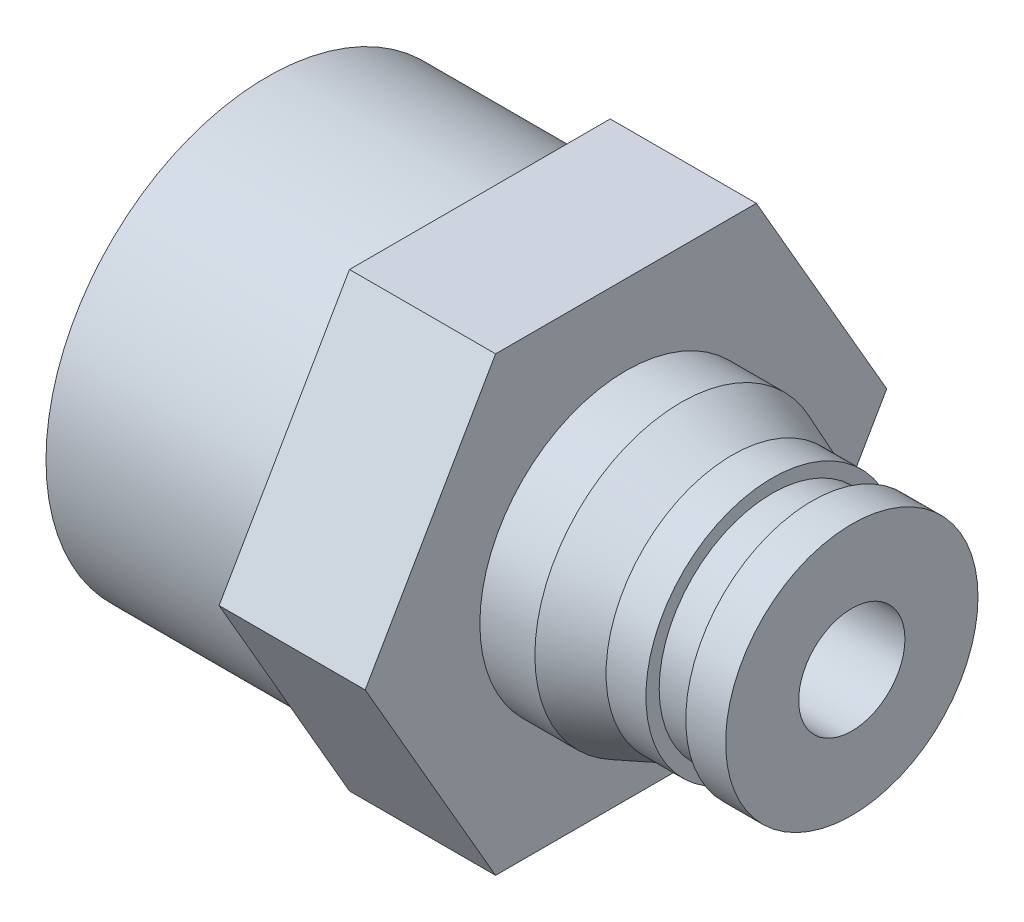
ISO-10303-21;
HEADER;
FILE_DESCRIPTION(('STEP AP214'),'2;1');
FILE_NAME('part.step','',(''),(''),'','','');
FILE_SCHEMA(('AUTOMOTIVE_DESIGN { 1 0 10303 214 1 1 1 1 }'));
ENDSEC;
DATA;
#1=APPLICATION_CONTEXT('core data for automotive mechanical design processes');
#2=APPLICATION_PROTOCOL_DEFINITION('international standard','automotive_design',2000,#1);
#3=PRODUCT_CONTEXT('',#1,'mechanical');
#4=PRODUCT('Part','Part','',(#3));
#5=PRODUCT_RELATED_PRODUCT_CATEGORY('part','',(#4));
#6=PRODUCT_DEFINITION_FORMATION('','',#4);
#7=PRODUCT_DEFINITION_CONTEXT('part definition',#1,'design');
#8=PRODUCT_DEFINITION('design','',#6,#7);
#9=PRODUCT_DEFINITION_SHAPE('','',#8);
#10=(LENGTH_UNIT() NAMED_UNIT(*) SI_UNIT(.MILLI.,.METRE.));
#11=(NAMED_UNIT(*) PLANE_ANGLE_UNIT() SI_UNIT($,.RADIAN.));
#12=(NAMED_UNIT(*) SI_UNIT($,.STERADIAN.) SOLID_ANGLE_UNIT());
#13=UNCERTAINTY_MEASURE_WITH_UNIT(LENGTH_MEASURE(1.E-05),#10,'distance_accuracy_value','');
#14=(GEOMETRIC_REPRESENTATION_CONTEXT(3) GLOBAL_UNCERTAINTY_ASSIGNED_CONTEXT((#13)) GLOBAL_UNIT_ASSIGNED_CONTEXT((#10,
#11,#12)) REPRESENTATION_CONTEXT('',''));
#15=CARTESIAN_POINT('',(0.,0.,0.));
#16=DIRECTION('',(0.,0.,1.));
#17=DIRECTION('',(1.,0.,0.));
#18=AXIS2_PLACEMENT_3D('',#15,#16,#17);
#19=CARTESIAN_POINT('',(8.,8.33,0.));
#20=DIRECTION('',(-1.,0.,0.));
#21=DIRECTION('',(0.,0.,1.));
#22=AXIS2_PLACEMENT_3D('',#19,#20,#21);
#23=PLANE('',#22);
#24=CARTESIAN_POINT('',(8.,0.,0.));
#25=DIRECTION('',(1.,0.,0.));
#26=DIRECTION('',(0.,0.,-1.));
#27=AXIS2_PLACEMENT_3D('',#24,#25,#26);
#28=CIRCLE('',#27,8.33);
#29=CARTESIAN_POINT('',(8.,0.,-8.33));
#30=VERTEX_POINT('',#29);
#31=EDGE_CURVE('E215',#30,#30,#28,.T.);
#32=ORIENTED_EDGE('',*,*,#31,.T.);
#33=EDGE_LOOP('',(#32));
#34=FACE_BOUND('',#33,.T.);
#35=DIRECTION('',(0.,-0.866025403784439,0.5));
#36=VECTOR('',#35,1.);
#37=CARTESIAN_POINT('',(8.,0.,-9.81495457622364));
#38=LINE('',#37,#36);
#39=CARTESIAN_POINT('',(8.,0.,-9.81495457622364));
#40=VERTEX_POINT('',#39);
#41=CARTESIAN_POINT('',(8.,-8.5,-4.90747728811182));
#42=VERTEX_POINT('',#41);
#43=EDGE_CURVE('E121',#40,#42,#38,.T.);
#44=ORIENTED_EDGE('',*,*,#43,.T.);
#45=DIRECTION('',(0.,0.,1.));
#46=VECTOR('',#45,1.);
#47=CARTESIAN_POINT('',(8.,-8.5,-4.90747728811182));
#48=LINE('',#47,#46);
#49=CARTESIAN_POINT('',(8.,-8.5,4.90747728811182));
#50=VERTEX_POINT('',#49);
#51=EDGE_CURVE('E106',#42,#50,#48,.T.);
#52=ORIENTED_EDGE('',*,*,#51,.T.);
#53=DIRECTION('',(0.,0.866025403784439,0.5));
#54=VECTOR('',#53,1.);
#55=CARTESIAN_POINT('',(8.,-8.5,4.90747728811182));
#56=LINE('',#55,#54);
#57=CARTESIAN_POINT('',(8.,0.,9.81495457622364));
#58=VERTEX_POINT('',#57);
#59=EDGE_CURVE('E115',#50,#58,#56,.T.);
#60=ORIENTED_EDGE('',*,*,#59,.T.);
#61=DIRECTION('',(0.,0.866025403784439,-0.5));
#62=VECTOR('',#61,1.);
#63=CARTESIAN_POINT('',(8.,0.,9.81495457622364));
#64=LINE('',#63,#62);
#65=CARTESIAN_POINT('',(8.,8.5,4.90747728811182));
#66=VERTEX_POINT('',#65);
#67=EDGE_CURVE('E30',#58,#66,#64,.T.);
#68=ORIENTED_EDGE('',*,*,#67,.T.);
#69=DIRECTION('',(0.,0.,-1.));
#70=VECTOR('',#69,1.);
#71=CARTESIAN_POINT('',(8.,8.5,4.90747728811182));
#72=LINE('',#71,#70);
#73=CARTESIAN_POINT('',(8.,8.5,-4.90747728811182));
#74=VERTEX_POINT('',#73);
#75=EDGE_CURVE('E125',#66,#74,#72,.T.);
#76=ORIENTED_EDGE('',*,*,#75,.T.);
#77=DIRECTION('',(0.,-0.866025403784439,-0.5));
#78=VECTOR('',#77,1.);
#79=CARTESIAN_POINT('',(8.,8.5,-4.90747728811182));
#80=LINE('',#79,#78);
#81=EDGE_CURVE('E128',#74,#40,#80,.T.);
#82=ORIENTED_EDGE('',*,*,#81,.T.);
#83=EDGE_LOOP('',(#44,#52,#60,#68,#76,#82));
#84=FACE_BOUND('',#83,.T.);
#85=ADVANCED_FACE('F15',(#34,#84),#23,.T.);
#86=CARTESIAN_POINT('',(13.5,10.5,0.));
#87=DIRECTION('',(1.,0.,0.));
#88=DIRECTION('',(0.,0.,-1.));
#89=AXIS2_PLACEMENT_3D('',#86,#87,#88);
#90=PLANE('',#89);
#91=CARTESIAN_POINT('',(13.5,0.,0.));
#92=DIRECTION('',(1.,0.,0.));
#93=DIRECTION('',(0.,0.,-1.));
#94=AXIS2_PLACEMENT_3D('',#91,#92,#93);
#95=CIRCLE('',#94,5.49960260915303);
#96=CARTESIAN_POINT('',(13.5,0.,-5.49960260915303));
#97=VERTEX_POINT('',#96);
#98=EDGE_CURVE('E212',#97,#97,#95,.T.);
#99=ORIENTED_EDGE('',*,*,#98,.F.);
#100=EDGE_LOOP('',(#99));
#101=FACE_BOUND('',#100,.T.);
#102=DIRECTION('',(0.,0.866025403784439,0.5));
#103=VECTOR('',#102,1.);
#104=CARTESIAN_POINT('',(13.5,-8.5,4.90747728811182));
#105=LINE('',#104,#103);
#106=CARTESIAN_POINT('',(13.5,-8.5,4.90747728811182));
#107=VERTEX_POINT('',#106);
#108=CARTESIAN_POINT('',(13.5,0.,9.81495457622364));
#109=VERTEX_POINT('',#108);
#110=EDGE_CURVE('E132',#107,#109,#105,.T.);
#111=ORIENTED_EDGE('',*,*,#110,.F.);
#112=DIRECTION('',(0.,0.,1.));
#113=VECTOR('',#112,1.);
#114=CARTESIAN_POINT('',(13.5,-8.5,-4.90747728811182));
#115=LINE('',#114,#113);
#116=CARTESIAN_POINT('',(13.5,-8.5,-4.90747728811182));
#117=VERTEX_POINT('',#116);
#118=EDGE_CURVE('E38',#117,#107,#115,.T.);
#119=ORIENTED_EDGE('',*,*,#118,.F.);
#120=DIRECTION('',(0.,-0.866025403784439,0.5));
#121=VECTOR('',#120,1.);
#122=CARTESIAN_POINT('',(13.5,0.,-9.81495457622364));
#123=LINE('',#122,#121);
#124=CARTESIAN_POINT('',(13.5,0.,-9.81495457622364));
#125=VERTEX_POINT('',#124);
#126=EDGE_CURVE('E112',#125,#117,#123,.T.);
#127=ORIENTED_EDGE('',*,*,#126,.F.);
#128=DIRECTION('',(0.,-0.866025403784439,-0.5));
#129=VECTOR('',#128,1.);
#130=CARTESIAN_POINT('',(13.5,8.5,-4.90747728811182));
#131=LINE('',#130,#129);
#132=CARTESIAN_POINT('',(13.5,8.5,-4.90747728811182));
#133=VERTEX_POINT('',#132);
#134=EDGE_CURVE('E140',#133,#125,#131,.T.);
#135=ORIENTED_EDGE('',*,*,#134,.F.);
#136=DIRECTION('',(0.,0.,-1.));
#137=VECTOR('',#136,1.);
#138=CARTESIAN_POINT('',(13.5,8.5,4.90747728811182));
#139=LINE('',#138,#137);
#140=CARTESIAN_POINT('',(13.5,8.5,4.90747728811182));
#141=VERTEX_POINT('',#140);
#142=EDGE_CURVE('E137',#141,#133,#139,.T.);
#143=ORIENTED_EDGE('',*,*,#142,.F.);
#144=DIRECTION('',(0.,0.866025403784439,-0.5));
#145=VECTOR('',#144,1.);
#146=CARTESIAN_POINT('',(13.5,0.,9.81495457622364));
#147=LINE('',#146,#145);
#148=EDGE_CURVE('E134',#109,#141,#147,.T.);
#149=ORIENTED_EDGE('',*,*,#148,.F.);
#150=EDGE_LOOP('',(#111,#119,#127,#135,#143,#149));
#151=FACE_BOUND('',#150,.T.);
#152=ADVANCED_FACE('F269',(#101,#151),#90,.T.);
#153=CARTESIAN_POINT('',(0.,0.,0.));
#154=DIRECTION('',(-1.,0.,0.));
#155=DIRECTION('',(0.,0.,1.));
#156=AXIS2_PLACEMENT_3D('',#153,#154,#155);
#157=PLANE('',#156);
#158=CARTESIAN_POINT('',(0.,0.,0.));
#159=DIRECTION('',(1.,0.,0.));
#160=DIRECTION('',(0.,0.,-1.));
#161=AXIS2_PLACEMENT_3D('',#158,#159,#160);
#162=CIRCLE('',#161,8.33);
#163=CARTESIAN_POINT('',(0.,0.,-8.33));
#164=VERTEX_POINT('',#163);
#165=EDGE_CURVE('E218',#164,#164,#162,.T.);
#166=ORIENTED_EDGE('',*,*,#165,.F.);
#167=EDGE_LOOP('',(#166));
#168=FACE_BOUND('',#167,.T.);
#169=DIRECTION('',(0.,-0.866025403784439,-0.5));
#170=VECTOR('',#169,1.);
#171=CARTESIAN_POINT('',(0.,0.,1.73205080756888));
#172=LINE('',#171,#170);
#173=CARTESIAN_POINT('',(0.,0.,1.73205080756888));
#174=VERTEX_POINT('',#173);
#175=CARTESIAN_POINT('',(0.,-1.5,0.866025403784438));
#176=VERTEX_POINT('',#175);
#177=EDGE_CURVE('E169',#174,#176,#172,.T.);
#178=ORIENTED_EDGE('',*,*,#177,.T.);
#179=DIRECTION('',(0.,0.,-1.));
#180=VECTOR('',#179,1.);
#181=CARTESIAN_POINT('',(0.,-1.5,0.866025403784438));
#182=LINE('',#181,#180);
#183=CARTESIAN_POINT('',(0.,-1.5,-0.866025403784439));
#184=VERTEX_POINT('',#183);
#185=EDGE_CURVE('E147',#176,#184,#182,.T.);
#186=ORIENTED_EDGE('',*,*,#185,.T.);
#187=DIRECTION('',(0.,0.866025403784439,-0.5));
#188=VECTOR('',#187,1.);
#189=CARTESIAN_POINT('',(0.,-1.5,-0.866025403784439));
#190=LINE('',#189,#188);
#191=CARTESIAN_POINT('',(0.,0.,-1.73205080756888));
#192=VERTEX_POINT('',#191);
#193=EDGE_CURVE('E157',#184,#192,#190,.T.);
#194=ORIENTED_EDGE('',*,*,#193,.T.);
#195=DIRECTION('',(0.,0.866025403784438,0.5));
#196=VECTOR('',#195,1.);
#197=CARTESIAN_POINT('',(0.,0.,-1.73205080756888));
#198=LINE('',#197,#196);
#199=CARTESIAN_POINT('',(0.,1.5,-0.866025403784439));
#200=VERTEX_POINT('',#199);
#201=EDGE_CURVE('E160',#192,#200,#198,.T.);
#202=ORIENTED_EDGE('',*,*,#201,.T.);
#203=DIRECTION('',(0.,0.,1.));
#204=VECTOR('',#203,1.);
#205=CARTESIAN_POINT('',(0.,1.5,-0.866025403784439));
#206=LINE('',#205,#204);
#207=CARTESIAN_POINT('',(0.,1.5,0.866025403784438));
#208=VERTEX_POINT('',#207);
#209=EDGE_CURVE('E163',#200,#208,#206,.T.);
#210=ORIENTED_EDGE('',*,*,#209,.T.);
#211=DIRECTION('',(0.,-0.866025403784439,0.5));
#212=VECTOR('',#211,1.);
#213=CARTESIAN_POINT('',(0.,1.5,0.866025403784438));
#214=LINE('',#213,#212);
#215=EDGE_CURVE('E166',#208,#174,#214,.T.);
#216=ORIENTED_EDGE('',*,*,#215,.T.);
#217=EDGE_LOOP('',(#178,#186,#194,#202,#210,#216));
#218=FACE_BOUND('',#217,.T.);
#219=ADVANCED_FACE('F17',(#168,#218),#157,.T.);
#220=CARTESIAN_POINT('',(5.99999999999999,2.,0.));
#221=DIRECTION('',(1.,0.,0.));
#222=DIRECTION('',(0.,0.,-1.));
#223=AXIS2_PLACEMENT_3D('',#220,#221,#222);
#224=PLANE('',#223);
#225=CARTESIAN_POINT('',(5.99999999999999,0.,0.));
#226=DIRECTION('',(1.,0.,0.));
#227=DIRECTION('',(0.,0.,-1.));
#228=AXIS2_PLACEMENT_3D('',#225,#226,#227);
#229=CIRCLE('',#228,2.);
#230=CARTESIAN_POINT('',(5.99999999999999,0.,-2.));
#231=VERTEX_POINT('',#230);
#232=EDGE_CURVE('E185',#231,#231,#229,.T.);
#233=ORIENTED_EDGE('',*,*,#232,.T.);
#234=EDGE_LOOP('',(#233));
#235=FACE_BOUND('',#234,.T.);
#236=DIRECTION('',(0.,-0.866025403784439,0.5));
#237=VECTOR('',#236,1.);
#238=CARTESIAN_POINT('',(5.99999999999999,0.750000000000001,-2.1650635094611));
#239=LINE('',#238,#237);
#240=CARTESIAN_POINT('',(5.99999999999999,0.,-1.73205080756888));
#241=VERTEX_POINT('',#240);
#242=CARTESIAN_POINT('',(5.99999999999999,-1.5,-0.866025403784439));
#243=VERTEX_POINT('',#242);
#244=EDGE_CURVE('E23',#241,#243,#239,.T.);
#245=ORIENTED_EDGE('',*,*,#244,.T.);
#246=DIRECTION('',(0.,0.,1.));
#247=VECTOR('',#246,1.);
#248=CARTESIAN_POINT('',(5.99999999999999,-1.5,0.));
#249=LINE('',#248,#247);
#250=CARTESIAN_POINT('',(5.99999999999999,-1.5,0.866025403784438));
#251=VERTEX_POINT('',#250);
#252=EDGE_CURVE('E10',#243,#251,#249,.T.);
#253=ORIENTED_EDGE('',*,*,#252,.T.);
#254=DIRECTION('',(0.,0.866025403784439,0.5));
#255=VECTOR('',#254,1.);
#256=CARTESIAN_POINT('',(5.99999999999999,0.75,2.1650635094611));
#257=LINE('',#256,#255);
#258=CARTESIAN_POINT('',(5.99999999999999,0.,1.73205080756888));
#259=VERTEX_POINT('',#258);
#260=EDGE_CURVE('E221',#251,#259,#257,.T.);
#261=ORIENTED_EDGE('',*,*,#260,.T.);
#262=DIRECTION('',(0.,0.866025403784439,-0.5));
#263=VECTOR('',#262,1.);
#264=CARTESIAN_POINT('',(5.99999999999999,2.25,0.433012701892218));
#265=LINE('',#264,#263);
#266=CARTESIAN_POINT('',(5.99999999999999,1.5,0.866025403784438));
#267=VERTEX_POINT('',#266);
#268=EDGE_CURVE('E224',#259,#267,#265,.T.);
#269=ORIENTED_EDGE('',*,*,#268,.T.);
#270=DIRECTION('',(0.,0.,-1.));
#271=VECTOR('',#270,1.);
#272=CARTESIAN_POINT('',(5.99999999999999,1.5,0.));
#273=LINE('',#272,#271);
#274=CARTESIAN_POINT('',(5.99999999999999,1.5,-0.866025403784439));
#275=VERTEX_POINT('',#274);
#276=EDGE_CURVE('E227',#267,#275,#273,.T.);
#277=ORIENTED_EDGE('',*,*,#276,.T.);
#278=DIRECTION('',(0.,-0.866025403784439,-0.5));
#279=VECTOR('',#278,1.);
#280=CARTESIAN_POINT('',(5.99999999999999,2.25,-0.433012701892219));
#281=LINE('',#280,#279);
#282=EDGE_CURVE('E230',#275,#241,#281,.T.);
#283=ORIENTED_EDGE('',*,*,#282,.T.);
#284=EDGE_LOOP('',(#245,#253,#261,#269,#277,#283));
#285=FACE_BOUND('',#284,.T.);
#286=ADVANCED_FACE('F234',(#235,#285),#224,.T.);
#287=CARTESIAN_POINT('',(0.,0.,0.));
#288=DIRECTION('',(1.,0.,0.));
#289=DIRECTION('',(0.,0.,-1.));
#290=AXIS2_PLACEMENT_3D('',#287,#288,#289);
#291=CYLINDRICAL_SURFACE('',#290,8.33);
#292=ORIENTED_EDGE('',*,*,#165,.T.);
#293=EDGE_LOOP('',(#292));
#294=FACE_BOUND('',#293,.T.);
#295=ORIENTED_EDGE('',*,*,#31,.F.);
#296=EDGE_LOOP('',(#295));
#297=FACE_BOUND('',#296,.T.);
#298=ADVANCED_FACE('F278',(#294,#297),#291,.T.);
#299=CARTESIAN_POINT('',(0.,0.,0.));
#300=DIRECTION('',(1.,0.,0.));
#301=DIRECTION('',(0.,0.,-1.));
#302=AXIS2_PLACEMENT_3D('',#299,#300,#301);
#303=CYLINDRICAL_SURFACE('',#302,5.49960260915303);
#304=ORIENTED_EDGE('',*,*,#98,.T.);
#305=EDGE_LOOP('',(#304));
#306=FACE_BOUND('',#305,.T.);
#307=CARTESIAN_POINT('',(15.5702380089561,0.,0.));
#308=DIRECTION('',(1.,0.,0.));
#309=DIRECTION('',(0.,0.,-1.));
#310=AXIS2_PLACEMENT_3D('',#307,#308,#309);
#311=CIRCLE('',#310,5.49960260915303);
#312=CARTESIAN_POINT('',(15.5702380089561,0.,-5.49960260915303));
#313=VERTEX_POINT('',#312);
#314=EDGE_CURVE('E209',#313,#313,#311,.T.);
#315=ORIENTED_EDGE('',*,*,#314,.F.);
#316=EDGE_LOOP('',(#315));
#317=FACE_BOUND('',#316,.T.);
#318=ADVANCED_FACE('F280',(#306,#317),#303,.T.);
#319=CARTESIAN_POINT('',(17.5,0.,0.));
#320=DIRECTION('',(-1.,0.,0.));
#321=DIRECTION('',(0.,0.,1.));
#322=AXIS2_PLACEMENT_3D('',#319,#320,#321);
#323=CONICAL_SURFACE('',#322,4.75,0.370503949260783);
#324=ORIENTED_EDGE('',*,*,#314,.T.);
#325=EDGE_LOOP('',(#324));
#326=FACE_BOUND('',#325,.T.);
#327=CARTESIAN_POINT('',(17.5,0.,0.));
#328=DIRECTION('',(1.,0.,0.));
#329=DIRECTION('',(0.,0.,-1.));
#330=AXIS2_PLACEMENT_3D('',#327,#328,#329);
#331=CIRCLE('',#330,4.75);
#332=CARTESIAN_POINT('',(17.5,0.,-4.75));
#333=VERTEX_POINT('',#332);
#334=EDGE_CURVE('E206',#333,#333,#331,.T.);
#335=ORIENTED_EDGE('',*,*,#334,.F.);
#336=EDGE_LOOP('',(#335));
#337=FACE_BOUND('',#336,.T.);
#338=ADVANCED_FACE('F286',(#326,#337),#323,.T.);
#339=CARTESIAN_POINT('',(0.,0.,0.));
#340=DIRECTION('',(1.,0.,0.));
#341=DIRECTION('',(0.,0.,-1.));
#342=AXIS2_PLACEMENT_3D('',#339,#340,#341);
#343=CYLINDRICAL_SURFACE('',#342,4.75);
#344=ORIENTED_EDGE('',*,*,#334,.T.);
#345=EDGE_LOOP('',(#344));
#346=FACE_BOUND('',#345,.T.);
#347=CARTESIAN_POINT('',(19.,0.,0.));
#348=DIRECTION('',(1.,0.,0.));
#349=DIRECTION('',(0.,0.,-1.));
#350=AXIS2_PLACEMENT_3D('',#347,#348,#349);
#351=CIRCLE('',#350,4.75);
#352=CARTESIAN_POINT('',(19.,0.,-4.75));
#353=VERTEX_POINT('',#352);
#354=EDGE_CURVE('E203',#353,#353,#351,.T.);
#355=ORIENTED_EDGE('',*,*,#354,.F.);
#356=EDGE_LOOP('',(#355));
#357=FACE_BOUND('',#356,.T.);
#358=ADVANCED_FACE('F330',(#346,#357),#343,.T.);
#359=CARTESIAN_POINT('',(19.,4.75,0.));
#360=DIRECTION('',(1.,0.,0.));
#361=DIRECTION('',(0.,0.,-1.));
#362=AXIS2_PLACEMENT_3D('',#359,#360,#361);
#363=PLANE('',#362);
#364=ORIENTED_EDGE('',*,*,#354,.T.);
#365=EDGE_LOOP('',(#364));
#366=FACE_BOUND('',#365,.T.);
#367=CARTESIAN_POINT('',(19.,0.,0.));
#368=DIRECTION('',(1.,0.,0.));
#369=DIRECTION('',(0.,0.,-1.));
#370=AXIS2_PLACEMENT_3D('',#367,#368,#369);
#371=CIRCLE('',#370,4.25);
#372=CARTESIAN_POINT('',(19.,0.,-4.25));
#373=VERTEX_POINT('',#372);
#374=EDGE_CURVE('E200',#373,#373,#371,.T.);
#375=ORIENTED_EDGE('',*,*,#374,.F.);
#376=EDGE_LOOP('',(#375));
#377=FACE_BOUND('',#376,.T.);
#378=ADVANCED_FACE('F340',(#366,#377),#363,.T.);
#379=CARTESIAN_POINT('',(0.,0.,0.));
#380=DIRECTION('',(1.,0.,0.));
#381=DIRECTION('',(0.,0.,-1.));
#382=AXIS2_PLACEMENT_3D('',#379,#380,#381);
#383=CYLINDRICAL_SURFACE('',#382,4.25);
#384=ORIENTED_EDGE('',*,*,#374,.T.);
#385=EDGE_LOOP('',(#384));
#386=FACE_BOUND('',#385,.T.);
#387=CARTESIAN_POINT('',(20.5,0.,0.));
#388=DIRECTION('',(1.,0.,0.));
#389=DIRECTION('',(0.,0.,-1.));
#390=AXIS2_PLACEMENT_3D('',#387,#388,#389);
#391=CIRCLE('',#390,4.25);
#392=CARTESIAN_POINT('',(20.5,0.,-4.25));
#393=VERTEX_POINT('',#392);
#394=EDGE_CURVE('E197',#393,#393,#391,.T.);
#395=ORIENTED_EDGE('',*,*,#394,.F.);
#396=EDGE_LOOP('',(#395));
#397=FACE_BOUND('',#396,.T.);
#398=ADVANCED_FACE('F350',(#386,#397),#383,.T.);
#399=CARTESIAN_POINT('',(20.5,4.25,0.));
#400=DIRECTION('',(-1.,0.,0.));
#401=DIRECTION('',(0.,0.,1.));
#402=AXIS2_PLACEMENT_3D('',#399,#400,#401);
#403=PLANE('',#402);
#404=ORIENTED_EDGE('',*,*,#394,.T.);
#405=EDGE_LOOP('',(#404));
#406=FACE_BOUND('',#405,.T.);
#407=CARTESIAN_POINT('',(20.5,0.,0.));
#408=DIRECTION('',(1.,0.,0.));
#409=DIRECTION('',(0.,0.,-1.));
#410=AXIS2_PLACEMENT_3D('',#407,#408,#409);
#411=CIRCLE('',#410,4.75);
#412=CARTESIAN_POINT('',(20.5,0.,-4.75));
#413=VERTEX_POINT('',#412);
#414=EDGE_CURVE('E194',#413,#413,#411,.T.);
#415=ORIENTED_EDGE('',*,*,#414,.F.);
#416=EDGE_LOOP('',(#415));
#417=FACE_BOUND('',#416,.T.);
#418=ADVANCED_FACE('F361',(#406,#417),#403,.T.);
#419=CARTESIAN_POINT('',(0.,0.,0.));
#420=DIRECTION('',(1.,0.,0.));
#421=DIRECTION('',(0.,0.,-1.));
#422=AXIS2_PLACEMENT_3D('',#419,#420,#421);
#423=CYLINDRICAL_SURFACE('',#422,4.75);
#424=ORIENTED_EDGE('',*,*,#414,.T.);
#425=EDGE_LOOP('',(#424));
#426=FACE_BOUND('',#425,.T.);
#427=CARTESIAN_POINT('',(22.,0.,0.));
#428=DIRECTION('',(1.,0.,0.));
#429=DIRECTION('',(0.,0.,-1.));
#430=AXIS2_PLACEMENT_3D('',#427,#428,#429);
#431=CIRCLE('',#430,4.75);
#432=CARTESIAN_POINT('',(22.,0.,-4.75));
#433=VERTEX_POINT('',#432);
#434=EDGE_CURVE('E191',#433,#433,#431,.T.);
#435=ORIENTED_EDGE('',*,*,#434,.F.);
#436=EDGE_LOOP('',(#435));
#437=FACE_BOUND('',#436,.T.);
#438=ADVANCED_FACE('F375',(#426,#437),#423,.T.);
#439=CARTESIAN_POINT('',(22.,4.75,0.));
#440=DIRECTION('',(1.,0.,0.));
#441=DIRECTION('',(0.,0.,-1.));
#442=AXIS2_PLACEMENT_3D('',#439,#440,#441);
#443=PLANE('',#442);
#444=ORIENTED_EDGE('',*,*,#434,.T.);
#445=EDGE_LOOP('',(#444));
#446=FACE_BOUND('',#445,.T.);
#447=CARTESIAN_POINT('',(22.,0.,0.));
#448=DIRECTION('',(1.,0.,0.));
#449=DIRECTION('',(0.,0.,-1.));
#450=AXIS2_PLACEMENT_3D('',#447,#448,#449);
#451=CIRCLE('',#450,2.);
#452=CARTESIAN_POINT('',(22.,0.,-2.));
#453=VERTEX_POINT('',#452);
#454=EDGE_CURVE('E188',#453,#453,#451,.T.);
#455=ORIENTED_EDGE('',*,*,#454,.F.);
#456=EDGE_LOOP('',(#455));
#457=FACE_BOUND('',#456,.T.);
#458=ADVANCED_FACE('F386',(#446,#457),#443,.T.);
#459=CARTESIAN_POINT('',(0.,0.,0.));
#460=DIRECTION('',(1.,0.,0.));
#461=DIRECTION('',(0.,0.,-1.));
#462=AXIS2_PLACEMENT_3D('',#459,#460,#461);
#463=CYLINDRICAL_SURFACE('',#462,2.);
#464=ORIENTED_EDGE('',*,*,#454,.T.);
#465=EDGE_LOOP('',(#464));
#466=FACE_BOUND('',#465,.T.);
#467=ORIENTED_EDGE('',*,*,#232,.F.);
#468=EDGE_LOOP('',(#467));
#469=FACE_BOUND('',#468,.T.);
#470=ADVANCED_FACE('F396',(#466,#469),#463,.F.);
#471=CARTESIAN_POINT('',(22.,-1.5,0.866025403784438));
#472=DIRECTION('',(0.,1.,0.));
#473=DIRECTION('',(0.,0.,1.));
#474=AXIS2_PLACEMENT_3D('',#471,#472,#473);
#475=PLANE('',#474);
#476=DIRECTION('',(-1.,0.,0.));
#477=VECTOR('',#476,1.);
#478=CARTESIAN_POINT('',(22.,-1.5,-0.866025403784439));
#479=LINE('',#478,#477);
#480=EDGE_CURVE('E183',#243,#184,#479,.T.);
#481=ORIENTED_EDGE('',*,*,#480,.T.);
#482=ORIENTED_EDGE('',*,*,#185,.F.);
#483=DIRECTION('',(-1.,0.,0.));
#484=VECTOR('',#483,1.);
#485=CARTESIAN_POINT('',(22.,-1.5,0.866025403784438));
#486=LINE('',#485,#484);
#487=EDGE_CURVE('E172',#251,#176,#486,.T.);
#488=ORIENTED_EDGE('',*,*,#487,.F.);
#489=ORIENTED_EDGE('',*,*,#252,.F.);
#490=EDGE_LOOP('',(#481,#482,#488,#489));
#491=FACE_BOUND('',#490,.T.);
#492=ADVANCED_FACE('F249',(#491),#475,.T.);
#493=CARTESIAN_POINT('',(22.,-1.5,-0.866025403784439));
#494=DIRECTION('',(0.,0.5,0.866025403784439));
#495=DIRECTION('',(0.,-0.866025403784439,0.5));
#496=AXIS2_PLACEMENT_3D('',#493,#494,#495);
#497=PLANE('',#496);
#498=DIRECTION('',(-1.,0.,0.));
#499=VECTOR('',#498,1.);
#500=CARTESIAN_POINT('',(22.,0.,-1.73205080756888));
#501=LINE('',#500,#499);
#502=EDGE_CURVE('E181',#241,#192,#501,.T.);
#503=ORIENTED_EDGE('',*,*,#502,.T.);
#504=ORIENTED_EDGE('',*,*,#193,.F.);
#505=ORIENTED_EDGE('',*,*,#480,.F.);
#506=ORIENTED_EDGE('',*,*,#244,.F.);
#507=EDGE_LOOP('',(#503,#504,#505,#506));
#508=FACE_BOUND('',#507,.T.);
#509=ADVANCED_FACE('F238',(#508),#497,.T.);
#510=CARTESIAN_POINT('',(22.,0.,-1.73205080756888));
#511=DIRECTION('',(0.,-0.5,0.866025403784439));
#512=DIRECTION('',(0.,-0.866025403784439,-0.5));
#513=AXIS2_PLACEMENT_3D('',#510,#511,#512);
#514=PLANE('',#513);
#515=DIRECTION('',(-1.,0.,0.));
#516=VECTOR('',#515,1.);
#517=CARTESIAN_POINT('',(22.,1.5,-0.866025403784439));
#518=LINE('',#517,#516);
#519=EDGE_CURVE('E179',#275,#200,#518,.T.);
#520=ORIENTED_EDGE('',*,*,#519,.T.);
#521=ORIENTED_EDGE('',*,*,#201,.F.);
#522=ORIENTED_EDGE('',*,*,#502,.F.);
#523=ORIENTED_EDGE('',*,*,#282,.F.);
#524=EDGE_LOOP('',(#520,#521,#522,#523));
#525=FACE_BOUND('',#524,.T.);
#526=ADVANCED_FACE('F242',(#525),#514,.T.);
#527=CARTESIAN_POINT('',(22.,1.5,-0.866025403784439));
#528=DIRECTION('',(0.,-1.,0.));
#529=DIRECTION('',(0.,0.,-1.));
#530=AXIS2_PLACEMENT_3D('',#527,#528,#529);
#531=PLANE('',#530);
#532=DIRECTION('',(-1.,0.,0.));
#533=VECTOR('',#532,1.);
#534=CARTESIAN_POINT('',(22.,1.5,0.866025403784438));
#535=LINE('',#534,#533);
#536=EDGE_CURVE('E177',#267,#208,#535,.T.);
#537=ORIENTED_EDGE('',*,*,#536,.T.);
#538=ORIENTED_EDGE('',*,*,#209,.F.);
#539=ORIENTED_EDGE('',*,*,#519,.F.);
#540=ORIENTED_EDGE('',*,*,#276,.F.);
#541=EDGE_LOOP('',(#537,#538,#539,#540));
#542=FACE_BOUND('',#541,.T.);
#543=ADVANCED_FACE('F258',(#542),#531,.T.);
#544=CARTESIAN_POINT('',(22.,1.5,0.866025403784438));
#545=DIRECTION('',(0.,-0.5,-0.866025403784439));
#546=DIRECTION('',(0.,0.866025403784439,-0.5));
#547=AXIS2_PLACEMENT_3D('',#544,#545,#546);
#548=PLANE('',#547);
#549=DIRECTION('',(-1.,0.,0.));
#550=VECTOR('',#549,1.);
#551=CARTESIAN_POINT('',(22.,0.,1.73205080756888));
#552=LINE('',#551,#550);
#553=EDGE_CURVE('E175',#259,#174,#552,.T.);
#554=ORIENTED_EDGE('',*,*,#553,.T.);
#555=ORIENTED_EDGE('',*,*,#215,.F.);
#556=ORIENTED_EDGE('',*,*,#536,.F.);
#557=ORIENTED_EDGE('',*,*,#268,.F.);
#558=EDGE_LOOP('',(#554,#555,#556,#557));
#559=FACE_BOUND('',#558,.T.);
#560=ADVANCED_FACE('F255',(#559),#548,.T.);
#561=CARTESIAN_POINT('',(22.,0.,1.73205080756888));
#562=DIRECTION('',(0.,0.5,-0.866025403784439));
#563=DIRECTION('',(0.,0.866025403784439,0.5));
#564=AXIS2_PLACEMENT_3D('',#561,#562,#563);
#565=PLANE('',#564);
#566=ORIENTED_EDGE('',*,*,#487,.T.);
#567=ORIENTED_EDGE('',*,*,#177,.F.);
#568=ORIENTED_EDGE('',*,*,#553,.F.);
#569=ORIENTED_EDGE('',*,*,#260,.F.);
#570=EDGE_LOOP('',(#566,#567,#568,#569));
#571=FACE_BOUND('',#570,.T.);
#572=ADVANCED_FACE('F251',(#571),#565,.T.);
#573=CARTESIAN_POINT('',(13.5,-8.5,-4.90747728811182));
#574=DIRECTION('',(0.,-1.,0.));
#575=DIRECTION('',(0.,0.,-1.));
#576=AXIS2_PLACEMENT_3D('',#573,#574,#575);
#577=PLANE('',#576);
#578=DIRECTION('',(-1.,0.,0.));
#579=VECTOR('',#578,1.);
#580=CARTESIAN_POINT('',(13.5,-8.5,-4.90747728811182));
#581=LINE('',#580,#579);
#582=EDGE_CURVE('E145',#117,#42,#581,.T.);
#583=ORIENTED_EDGE('',*,*,#582,.F.);
#584=ORIENTED_EDGE('',*,*,#118,.T.);
#585=DIRECTION('',(-1.,0.,0.));
#586=VECTOR('',#585,1.);
#587=CARTESIAN_POINT('',(13.5,-8.5,4.90747728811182));
#588=LINE('',#587,#586);
#589=EDGE_CURVE('E102',#107,#50,#588,.T.);
#590=ORIENTED_EDGE('',*,*,#589,.T.);
#591=ORIENTED_EDGE('',*,*,#51,.F.);
#592=EDGE_LOOP('',(#583,#584,#590,#591));
#593=FACE_BOUND('',#592,.T.);
#594=ADVANCED_FACE('F104',(#593),#577,.T.);
#595=CARTESIAN_POINT('',(13.5,0.,-9.81495457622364));
#596=DIRECTION('',(0.,-0.5,-0.866025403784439));
#597=DIRECTION('',(0.,0.866025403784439,-0.5));
#598=AXIS2_PLACEMENT_3D('',#595,#596,#597);
#599=PLANE('',#598);
#600=DIRECTION('',(-1.,0.,0.));
#601=VECTOR('',#600,1.);
#602=CARTESIAN_POINT('',(13.5,0.,-9.81495457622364));
#603=LINE('',#602,#601);
#604=EDGE_CURVE('E148',#125,#40,#603,.T.);
#605=ORIENTED_EDGE('',*,*,#604,.F.);
#606=ORIENTED_EDGE('',*,*,#126,.T.);
#607=ORIENTED_EDGE('',*,*,#582,.T.);
#608=ORIENTED_EDGE('',*,*,#43,.F.);
#609=EDGE_LOOP('',(#605,#606,#607,#608));
#610=FACE_BOUND('',#609,.T.);
#611=ADVANCED_FACE('F457',(#610),#599,.T.);
#612=CARTESIAN_POINT('',(13.5,8.5,-4.90747728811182));
#613=DIRECTION('',(0.,0.5,-0.866025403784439));
#614=DIRECTION('',(0.,0.866025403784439,0.5));
#615=AXIS2_PLACEMENT_3D('',#612,#613,#614);
#616=PLANE('',#615);
#617=DIRECTION('',(-1.,0.,0.));
#618=VECTOR('',#617,1.);
#619=CARTESIAN_POINT('',(13.5,8.5,-4.90747728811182));
#620=LINE('',#619,#618);
#621=EDGE_CURVE('E150',#133,#74,#620,.T.);
#622=ORIENTED_EDGE('',*,*,#621,.F.);
#623=ORIENTED_EDGE('',*,*,#134,.T.);
#624=ORIENTED_EDGE('',*,*,#604,.T.);
#625=ORIENTED_EDGE('',*,*,#81,.F.);
#626=EDGE_LOOP('',(#622,#623,#624,#625));
#627=FACE_BOUND('',#626,.T.);
#628=ADVANCED_FACE('F466',(#627),#616,.T.);
#629=CARTESIAN_POINT('',(13.5,8.5,4.90747728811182));
#630=DIRECTION('',(0.,1.,0.));
#631=DIRECTION('',(0.,0.,1.));
#632=AXIS2_PLACEMENT_3D('',#629,#630,#631);
#633=PLANE('',#632);
#634=DIRECTION('',(-1.,0.,0.));
#635=VECTOR('',#634,1.);
#636=CARTESIAN_POINT('',(13.5,8.5,4.90747728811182));
#637=LINE('',#636,#635);
#638=EDGE_CURVE('E152',#141,#66,#637,.T.);
#639=ORIENTED_EDGE('',*,*,#638,.F.);
#640=ORIENTED_EDGE('',*,*,#142,.T.);
#641=ORIENTED_EDGE('',*,*,#621,.T.);
#642=ORIENTED_EDGE('',*,*,#75,.F.);
#643=EDGE_LOOP('',(#639,#640,#641,#642));
#644=FACE_BOUND('',#643,.T.);
#645=ADVANCED_FACE('F476',(#644),#633,.T.);
#646=CARTESIAN_POINT('',(13.5,0.,9.81495457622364));
#647=DIRECTION('',(0.,0.5,0.866025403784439));
#648=DIRECTION('',(0.,-0.866025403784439,0.5));
#649=AXIS2_PLACEMENT_3D('',#646,#647,#648);
#650=PLANE('',#649);
#651=DIRECTION('',(-1.,0.,0.));
#652=VECTOR('',#651,1.);
#653=CARTESIAN_POINT('',(13.5,0.,9.81495457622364));
#654=LINE('',#653,#652);
#655=EDGE_CURVE('E111',#109,#58,#654,.T.);
#656=ORIENTED_EDGE('',*,*,#655,.F.);
#657=ORIENTED_EDGE('',*,*,#148,.T.);
#658=ORIENTED_EDGE('',*,*,#638,.T.);
#659=ORIENTED_EDGE('',*,*,#67,.F.);
#660=EDGE_LOOP('',(#656,#657,#658,#659));
#661=FACE_BOUND('',#660,.T.);
#662=ADVANCED_FACE('F486',(#661),#650,.T.);
#663=CARTESIAN_POINT('',(13.5,-8.5,4.90747728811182));
#664=DIRECTION('',(0.,-0.5,0.866025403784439));
#665=DIRECTION('',(0.,-0.866025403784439,-0.5));
#666=AXIS2_PLACEMENT_3D('',#663,#664,#665);
#667=PLANE('',#666);
#668=ORIENTED_EDGE('',*,*,#589,.F.);
#669=ORIENTED_EDGE('',*,*,#110,.T.);
#670=ORIENTED_EDGE('',*,*,#655,.T.);
#671=ORIENTED_EDGE('',*,*,#59,.F.);
#672=EDGE_LOOP('',(#668,#669,#670,#671));
#673=FACE_BOUND('',#672,.T.);
#674=ADVANCED_FACE('F116',(#673),#667,.T.);
#675=CLOSED_SHELL('',(#85,#152,#219,#286,#298,#318,#338,#358,#378,#398,#418,#438,#458,#470,#492,
#509,#526,#543,#560,#572,#594,#611,#628,#645,#662,#674));
#676=MANIFOLD_SOLID_BREP('B1',#675);
#677=ADVANCED_BREP_SHAPE_REPRESENTATION('',(#18,#676),#14);
#678=SHAPE_DEFINITION_REPRESENTATION(#9,#677);
ENDSEC;
END-ISO-10303-21;
